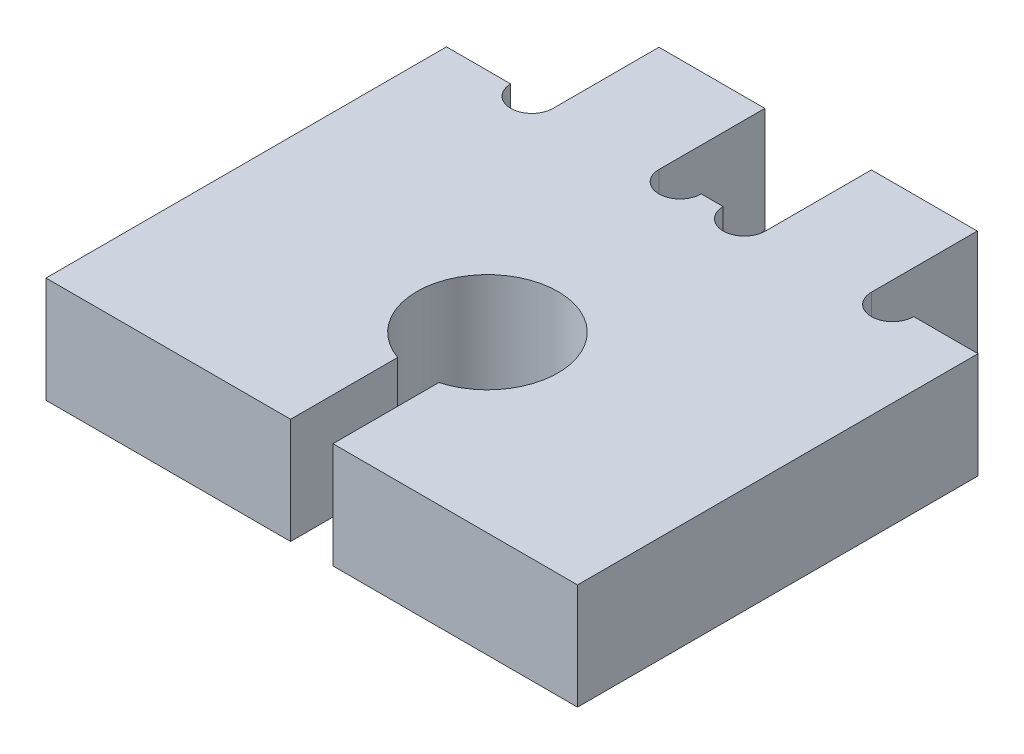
from build123d import *

# Parameters (mm, degrees)
AUFSATZ_LINEAR_AUSTRAGEN1_DEPTH = 15


with BuildPart() as part:
    # Skizze1 → Aufsatz-Linear austragen1 (new body)
    with BuildSketch(Plane(origin=(0, 0, 0), x_dir=(1, 0, 0), z_dir=(0, 1, 0))):
        with BuildLine():
            Line((0, 0), (0, 56.734188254))
            Line((0, 56.734188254), (9.1, 56.734188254))
            ThreePointArc((9.1, 56.734188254), (12.1, 53.734188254), (15.1, 56.734188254))
            Line((15.1, 56.734188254), (15.1, 71.734188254))
            Line((15.1, 71.734188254), (30.1, 71.734188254))
            Line((30.1, 71.734188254), (30.1, 56.734188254))
            ThreePointArc((30.1, 56.734188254), (33.1, 53.734188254), (36.1, 56.734188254))
            Line((36.1, 56.734188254), (39.2, 56.734188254))
            ThreePointArc((39.2, 56.734188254), (42.2, 53.734188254), (45.2, 56.734188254))
            Line((45.2, 56.734188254), (45.2, 71.734188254))
            Line((45.2, 71.734188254), (60.2, 71.734188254))
            Line((60.2, 71.734188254), (60.2, 56.734188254))
            ThreePointArc((60.2, 56.734188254), (63.2, 53.734188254), (66.2, 56.734188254))
            Line((66.2, 56.734188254), (75.3, 56.734188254))
            Line((75.3, 56.734188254), (75.3, 0))
            Line((75.3, 0), (40.65, 0))
            Line((40.65, 0), (40.65, 15))
            ThreePointArc((40.65, 15), (38.194219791, 34.615036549), (34.65, 15.167182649))
            Line((34.65, 15.167182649), (34.65, 0))
            Line((34.65, 0), (0, 0))
        make_face()
    extrude(amount=AUFSATZ_LINEAR_AUSTRAGEN1_DEPTH)


solid = part.part
